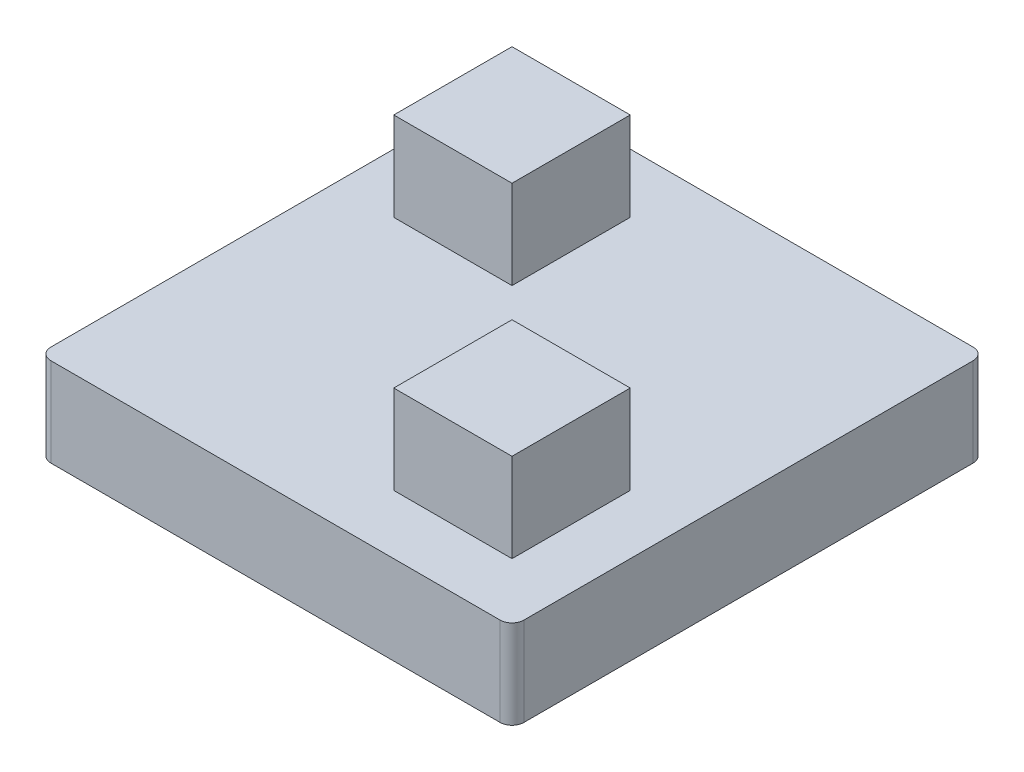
ISO-10303-21;
HEADER;
FILE_DESCRIPTION(('STEP AP214'),'2;1');
FILE_NAME('part.step','',(''),(''),'','','');
FILE_SCHEMA(('AUTOMOTIVE_DESIGN { 1 0 10303 214 1 1 1 1 }'));
ENDSEC;
DATA;
#1=APPLICATION_CONTEXT('core data for automotive mechanical design processes');
#2=APPLICATION_PROTOCOL_DEFINITION('international standard','automotive_design',2000,#1);
#3=PRODUCT_CONTEXT('',#1,'mechanical');
#4=PRODUCT('Part','Part','',(#3));
#5=PRODUCT_RELATED_PRODUCT_CATEGORY('part','',(#4));
#6=PRODUCT_DEFINITION_FORMATION('','',#4);
#7=PRODUCT_DEFINITION_CONTEXT('part definition',#1,'design');
#8=PRODUCT_DEFINITION('design','',#6,#7);
#9=PRODUCT_DEFINITION_SHAPE('','',#8);
#10=(LENGTH_UNIT() NAMED_UNIT(*) SI_UNIT(.MILLI.,.METRE.));
#11=(NAMED_UNIT(*) PLANE_ANGLE_UNIT() SI_UNIT($,.RADIAN.));
#12=(NAMED_UNIT(*) SI_UNIT($,.STERADIAN.) SOLID_ANGLE_UNIT());
#13=UNCERTAINTY_MEASURE_WITH_UNIT(LENGTH_MEASURE(1.E-05),#10,'distance_accuracy_value','');
#14=(GEOMETRIC_REPRESENTATION_CONTEXT(3) GLOBAL_UNCERTAINTY_ASSIGNED_CONTEXT((#13)) GLOBAL_UNIT_ASSIGNED_CONTEXT((#10,
#11,#12)) REPRESENTATION_CONTEXT('',''));
#15=CARTESIAN_POINT('',(0.,0.,0.));
#16=DIRECTION('',(0.,0.,1.));
#17=DIRECTION('',(1.,0.,0.));
#18=AXIS2_PLACEMENT_3D('',#15,#16,#17);
#19=CARTESIAN_POINT('',(-50.8,19.05,50.8));
#20=DIRECTION('',(0.,1.,0.));
#21=DIRECTION('',(0.,0.,1.));
#22=AXIS2_PLACEMENT_3D('',#19,#20,#21);
#23=PLANE('',#22);
#24=DIRECTION('',(-1.,0.,0.));
#25=VECTOR('',#24,1.);
#26=CARTESIAN_POINT('',(38.1,19.05,12.7));
#27=LINE('',#26,#25);
#28=CARTESIAN_POINT('',(38.1,19.05,12.7));
#29=VERTEX_POINT('',#28);
#30=CARTESIAN_POINT('',(12.7,19.05,12.7));
#31=VERTEX_POINT('',#30);
#32=EDGE_CURVE('E182',#29,#31,#27,.T.);
#33=ORIENTED_EDGE('',*,*,#32,.F.);
#34=DIRECTION('',(0.,0.,-1.));
#35=VECTOR('',#34,1.);
#36=CARTESIAN_POINT('',(38.1,19.05,38.1));
#37=LINE('',#36,#35);
#38=CARTESIAN_POINT('',(38.1,19.05,38.1));
#39=VERTEX_POINT('',#38);
#40=EDGE_CURVE('E176',#39,#29,#37,.T.);
#41=ORIENTED_EDGE('',*,*,#40,.F.);
#42=DIRECTION('',(1.,0.,0.));
#43=VECTOR('',#42,1.);
#44=CARTESIAN_POINT('',(38.1,19.05,38.1));
#45=LINE('',#44,#43);
#46=CARTESIAN_POINT('',(12.7,19.05,38.1));
#47=VERTEX_POINT('',#46);
#48=EDGE_CURVE('E201',#47,#39,#45,.T.);
#49=ORIENTED_EDGE('',*,*,#48,.F.);
#50=DIRECTION('',(0.,0.,1.));
#51=VECTOR('',#50,1.);
#52=CARTESIAN_POINT('',(12.7,19.05,38.1));
#53=LINE('',#52,#51);
#54=EDGE_CURVE('E198',#31,#47,#53,.T.);
#55=ORIENTED_EDGE('',*,*,#54,.F.);
#56=EDGE_LOOP('',(#33,#41,#49,#55));
#57=FACE_BOUND('',#56,.T.);
#58=DIRECTION('',(0.,0.,1.));
#59=VECTOR('',#58,1.);
#60=CARTESIAN_POINT('',(-50.8,19.05,-50.8));
#61=LINE('',#60,#59);
#62=CARTESIAN_POINT('',(-50.8,19.05,-48.26));
#63=VERTEX_POINT('',#62);
#64=CARTESIAN_POINT('',(-50.8,19.05,48.26));
#65=VERTEX_POINT('',#64);
#66=EDGE_CURVE('E234',#63,#65,#61,.T.);
#67=ORIENTED_EDGE('',*,*,#66,.T.);
#68=CARTESIAN_POINT('',(-48.26,19.05,48.26));
#69=DIRECTION('',(0.,1.,0.));
#70=DIRECTION('',(0.,0.,1.));
#71=AXIS2_PLACEMENT_3D('',#68,#69,#70);
#72=CIRCLE('',#71,2.54);
#73=CARTESIAN_POINT('',(-48.26,19.05,50.8));
#74=VERTEX_POINT('',#73);
#75=EDGE_CURVE('E267',#65,#74,#72,.T.);
#76=ORIENTED_EDGE('',*,*,#75,.T.);
#77=DIRECTION('',(1.,0.,0.));
#78=VECTOR('',#77,1.);
#79=CARTESIAN_POINT('',(-50.8,19.05,50.8));
#80=LINE('',#79,#78);
#81=CARTESIAN_POINT('',(48.26,19.05,50.8));
#82=VERTEX_POINT('',#81);
#83=EDGE_CURVE('E237',#74,#82,#80,.T.);
#84=ORIENTED_EDGE('',*,*,#83,.T.);
#85=CARTESIAN_POINT('',(48.26,19.05,48.26));
#86=DIRECTION('',(0.,1.,0.));
#87=DIRECTION('',(0.,0.,1.));
#88=AXIS2_PLACEMENT_3D('',#85,#86,#87);
#89=CIRCLE('',#88,2.54);
#90=CARTESIAN_POINT('',(50.8,19.05,48.26));
#91=VERTEX_POINT('',#90);
#92=EDGE_CURVE('E265',#82,#91,#89,.T.);
#93=ORIENTED_EDGE('',*,*,#92,.T.);
#94=DIRECTION('',(0.,0.,-1.));
#95=VECTOR('',#94,1.);
#96=CARTESIAN_POINT('',(50.8,19.05,-50.8));
#97=LINE('',#96,#95);
#98=CARTESIAN_POINT('',(50.8,19.05,-48.26));
#99=VERTEX_POINT('',#98);
#100=EDGE_CURVE('E240',#91,#99,#97,.T.);
#101=ORIENTED_EDGE('',*,*,#100,.T.);
#102=CARTESIAN_POINT('',(48.26,19.05,-48.26));
#103=DIRECTION('',(0.,1.,0.));
#104=DIRECTION('',(0.,0.,1.));
#105=AXIS2_PLACEMENT_3D('',#102,#103,#104);
#106=CIRCLE('',#105,2.54);
#107=CARTESIAN_POINT('',(48.26,19.05,-50.8));
#108=VERTEX_POINT('',#107);
#109=EDGE_CURVE('E57',#99,#108,#106,.T.);
#110=ORIENTED_EDGE('',*,*,#109,.T.);
#111=DIRECTION('',(-1.,0.,0.));
#112=VECTOR('',#111,1.);
#113=CARTESIAN_POINT('',(-50.8,19.05,-50.8));
#114=LINE('',#113,#112);
#115=CARTESIAN_POINT('',(-48.26,19.05,-50.8));
#116=VERTEX_POINT('',#115);
#117=EDGE_CURVE('E242',#108,#116,#114,.T.);
#118=ORIENTED_EDGE('',*,*,#117,.T.);
#119=CARTESIAN_POINT('',(-48.26,19.05,-48.26));
#120=DIRECTION('',(0.,1.,0.));
#121=DIRECTION('',(0.,0.,1.));
#122=AXIS2_PLACEMENT_3D('',#119,#120,#121);
#123=CIRCLE('',#122,2.54);
#124=EDGE_CURVE('E262',#116,#63,#123,.T.);
#125=ORIENTED_EDGE('',*,*,#124,.T.);
#126=EDGE_LOOP('',(#67,#76,#84,#93,#101,#110,#118,#125));
#127=FACE_BOUND('',#126,.T.);
#128=DIRECTION('',(-1.,0.,0.));
#129=VECTOR('',#128,1.);
#130=CARTESIAN_POINT('',(-12.7,19.05,-38.1));
#131=LINE('',#130,#129);
#132=CARTESIAN_POINT('',(-12.7,19.05,-38.1));
#133=VERTEX_POINT('',#132);
#134=CARTESIAN_POINT('',(-38.1,19.05,-38.1));
#135=VERTEX_POINT('',#134);
#136=EDGE_CURVE('E193',#133,#135,#131,.T.);
#137=ORIENTED_EDGE('',*,*,#136,.F.);
#138=DIRECTION('',(0.,0.,-1.));
#139=VECTOR('',#138,1.);
#140=CARTESIAN_POINT('',(-12.7,19.05,-38.1));
#141=LINE('',#140,#139);
#142=CARTESIAN_POINT('',(-12.7,19.05,-12.7));
#143=VERTEX_POINT('',#142);
#144=EDGE_CURVE('E186',#143,#133,#141,.T.);
#145=ORIENTED_EDGE('',*,*,#144,.F.);
#146=DIRECTION('',(1.,0.,0.));
#147=VECTOR('',#146,1.);
#148=CARTESIAN_POINT('',(-12.7,19.05,-12.7));
#149=LINE('',#148,#147);
#150=CARTESIAN_POINT('',(-38.1,19.05,-12.7));
#151=VERTEX_POINT('',#150);
#152=EDGE_CURVE('E160',#151,#143,#149,.T.);
#153=ORIENTED_EDGE('',*,*,#152,.F.);
#154=DIRECTION('',(0.,0.,1.));
#155=VECTOR('',#154,1.);
#156=CARTESIAN_POINT('',(-38.1,19.05,-38.1));
#157=LINE('',#156,#155);
#158=EDGE_CURVE('E156',#135,#151,#157,.T.);
#159=ORIENTED_EDGE('',*,*,#158,.F.);
#160=EDGE_LOOP('',(#137,#145,#153,#159));
#161=FACE_BOUND('',#160,.T.);
#162=ADVANCED_FACE('F36',(#57,#127,#161),#23,.T.);
#163=CARTESIAN_POINT('',(-50.8,19.05,-50.8));
#164=DIRECTION('',(1.,0.,0.));
#165=DIRECTION('',(0.,0.,-1.));
#166=AXIS2_PLACEMENT_3D('',#163,#164,#165);
#167=PLANE('',#166);
#168=DIRECTION('',(0.,0.,1.));
#169=VECTOR('',#168,1.);
#170=CARTESIAN_POINT('',(-50.8,0.,-50.8));
#171=LINE('',#170,#169);
#172=CARTESIAN_POINT('',(-50.8,0.,-48.26));
#173=VERTEX_POINT('',#172);
#174=CARTESIAN_POINT('',(-50.8,0.,48.26));
#175=VERTEX_POINT('',#174);
#176=EDGE_CURVE('E222',#173,#175,#171,.T.);
#177=ORIENTED_EDGE('',*,*,#176,.T.);
#178=DIRECTION('',(0.,-1.,0.));
#179=VECTOR('',#178,1.);
#180=CARTESIAN_POINT('',(-50.8,19.05,48.26));
#181=LINE('',#180,#179);
#182=EDGE_CURVE('E260',#175,#65,#181,.F.);
#183=ORIENTED_EDGE('',*,*,#182,.T.);
#184=ORIENTED_EDGE('',*,*,#66,.F.);
#185=DIRECTION('',(0.,-1.,0.));
#186=VECTOR('',#185,1.);
#187=CARTESIAN_POINT('',(-50.8,19.05,-48.26));
#188=LINE('',#187,#186);
#189=EDGE_CURVE('E257',#63,#173,#188,.T.);
#190=ORIENTED_EDGE('',*,*,#189,.T.);
#191=EDGE_LOOP('',(#177,#183,#184,#190));
#192=FACE_BOUND('',#191,.T.);
#193=ADVANCED_FACE('F38',(#192),#167,.F.);
#194=CARTESIAN_POINT('',(-50.8,19.05,50.8));
#195=DIRECTION('',(0.,0.,-1.));
#196=DIRECTION('',(-1.,0.,0.));
#197=AXIS2_PLACEMENT_3D('',#194,#195,#196);
#198=PLANE('',#197);
#199=ORIENTED_EDGE('',*,*,#83,.F.);
#200=DIRECTION('',(0.,-1.,0.));
#201=VECTOR('',#200,1.);
#202=CARTESIAN_POINT('',(-48.26,19.05,50.8));
#203=LINE('',#202,#201);
#204=CARTESIAN_POINT('',(-48.26,0.,50.8));
#205=VERTEX_POINT('',#204);
#206=EDGE_CURVE('E246',#74,#205,#203,.T.);
#207=ORIENTED_EDGE('',*,*,#206,.T.);
#208=DIRECTION('',(1.,0.,0.));
#209=VECTOR('',#208,1.);
#210=CARTESIAN_POINT('',(-50.8,0.,50.8));
#211=LINE('',#210,#209);
#212=CARTESIAN_POINT('',(48.26,0.,50.8));
#213=VERTEX_POINT('',#212);
#214=EDGE_CURVE('E226',#205,#213,#211,.T.);
#215=ORIENTED_EDGE('',*,*,#214,.T.);
#216=DIRECTION('',(0.,-1.,0.));
#217=VECTOR('',#216,1.);
#218=CARTESIAN_POINT('',(48.26,19.05,50.8));
#219=LINE('',#218,#217);
#220=EDGE_CURVE('E244',#213,#82,#219,.F.);
#221=ORIENTED_EDGE('',*,*,#220,.T.);
#222=EDGE_LOOP('',(#199,#207,#215,#221));
#223=FACE_BOUND('',#222,.T.);
#224=ADVANCED_FACE('F304',(#223),#198,.F.);
#225=CARTESIAN_POINT('',(50.8,19.05,-50.8));
#226=DIRECTION('',(-1.,0.,0.));
#227=DIRECTION('',(0.,0.,1.));
#228=AXIS2_PLACEMENT_3D('',#225,#226,#227);
#229=PLANE('',#228);
#230=ORIENTED_EDGE('',*,*,#100,.F.);
#231=DIRECTION('',(0.,-1.,0.));
#232=VECTOR('',#231,1.);
#233=CARTESIAN_POINT('',(50.8,19.05,48.26));
#234=LINE('',#233,#232);
#235=CARTESIAN_POINT('',(50.8,0.,48.26));
#236=VERTEX_POINT('',#235);
#237=EDGE_CURVE('E271',#91,#236,#234,.T.);
#238=ORIENTED_EDGE('',*,*,#237,.T.);
#239=DIRECTION('',(0.,0.,-1.));
#240=VECTOR('',#239,1.);
#241=CARTESIAN_POINT('',(50.8,0.,-50.8));
#242=LINE('',#241,#240);
#243=CARTESIAN_POINT('',(50.8,0.,-48.26));
#244=VERTEX_POINT('',#243);
#245=EDGE_CURVE('E229',#236,#244,#242,.T.);
#246=ORIENTED_EDGE('',*,*,#245,.T.);
#247=DIRECTION('',(0.,-1.,0.));
#248=VECTOR('',#247,1.);
#249=CARTESIAN_POINT('',(50.8,19.05,-48.26));
#250=LINE('',#249,#248);
#251=EDGE_CURVE('E269',#244,#99,#250,.F.);
#252=ORIENTED_EDGE('',*,*,#251,.T.);
#253=EDGE_LOOP('',(#230,#238,#246,#252));
#254=FACE_BOUND('',#253,.T.);
#255=ADVANCED_FACE('F277',(#254),#229,.F.);
#256=CARTESIAN_POINT('',(-50.8,19.05,-50.8));
#257=DIRECTION('',(0.,0.,1.));
#258=DIRECTION('',(1.,0.,0.));
#259=AXIS2_PLACEMENT_3D('',#256,#257,#258);
#260=PLANE('',#259);
#261=ORIENTED_EDGE('',*,*,#117,.F.);
#262=DIRECTION('',(0.,-1.,0.));
#263=VECTOR('',#262,1.);
#264=CARTESIAN_POINT('',(48.26,19.05,-50.8));
#265=LINE('',#264,#263);
#266=CARTESIAN_POINT('',(48.26,0.,-50.8));
#267=VERTEX_POINT('',#266);
#268=EDGE_CURVE('E11',#108,#267,#265,.T.);
#269=ORIENTED_EDGE('',*,*,#268,.T.);
#270=DIRECTION('',(-1.,0.,0.));
#271=VECTOR('',#270,1.);
#272=CARTESIAN_POINT('',(-50.8,0.,-50.8));
#273=LINE('',#272,#271);
#274=CARTESIAN_POINT('',(-48.26,0.,-50.8));
#275=VERTEX_POINT('',#274);
#276=EDGE_CURVE('E232',#267,#275,#273,.T.);
#277=ORIENTED_EDGE('',*,*,#276,.T.);
#278=DIRECTION('',(0.,-1.,0.));
#279=VECTOR('',#278,1.);
#280=CARTESIAN_POINT('',(-48.26,19.05,-50.8));
#281=LINE('',#280,#279);
#282=EDGE_CURVE('E44',#275,#116,#281,.F.);
#283=ORIENTED_EDGE('',*,*,#282,.T.);
#284=EDGE_LOOP('',(#261,#269,#277,#283));
#285=FACE_BOUND('',#284,.T.);
#286=ADVANCED_FACE('F288',(#285),#260,.F.);
#287=CARTESIAN_POINT('',(-50.8,0.,50.8));
#288=DIRECTION('',(0.,1.,0.));
#289=DIRECTION('',(0.,0.,1.));
#290=AXIS2_PLACEMENT_3D('',#287,#288,#289);
#291=PLANE('',#290);
#292=ORIENTED_EDGE('',*,*,#214,.F.);
#293=CARTESIAN_POINT('',(-48.26,0.,48.26));
#294=DIRECTION('',(0.,1.,0.));
#295=DIRECTION('',(0.,0.,1.));
#296=AXIS2_PLACEMENT_3D('',#293,#294,#295);
#297=CIRCLE('',#296,2.54);
#298=EDGE_CURVE('E255',#205,#175,#297,.F.);
#299=ORIENTED_EDGE('',*,*,#298,.T.);
#300=ORIENTED_EDGE('',*,*,#176,.F.);
#301=CARTESIAN_POINT('',(-48.26,0.,-48.26));
#302=DIRECTION('',(0.,1.,0.));
#303=DIRECTION('',(0.,0.,1.));
#304=AXIS2_PLACEMENT_3D('',#301,#302,#303);
#305=CIRCLE('',#304,2.54);
#306=EDGE_CURVE('E249',#173,#275,#305,.F.);
#307=ORIENTED_EDGE('',*,*,#306,.T.);
#308=ORIENTED_EDGE('',*,*,#276,.F.);
#309=CARTESIAN_POINT('',(48.26,0.,-48.26));
#310=DIRECTION('',(0.,1.,0.));
#311=DIRECTION('',(0.,0.,1.));
#312=AXIS2_PLACEMENT_3D('',#309,#310,#311);
#313=CIRCLE('',#312,2.54);
#314=EDGE_CURVE('E251',#267,#244,#313,.F.);
#315=ORIENTED_EDGE('',*,*,#314,.T.);
#316=ORIENTED_EDGE('',*,*,#245,.F.);
#317=CARTESIAN_POINT('',(48.26,0.,48.26));
#318=DIRECTION('',(0.,1.,0.));
#319=DIRECTION('',(0.,0.,1.));
#320=AXIS2_PLACEMENT_3D('',#317,#318,#319);
#321=CIRCLE('',#320,2.54);
#322=EDGE_CURVE('E253',#236,#213,#321,.F.);
#323=ORIENTED_EDGE('',*,*,#322,.T.);
#324=EDGE_LOOP('',(#292,#299,#300,#307,#308,#315,#316,#323));
#325=FACE_BOUND('',#324,.T.);
#326=ADVANCED_FACE('F283',(#325),#291,.F.);
#327=CARTESIAN_POINT('',(38.1,38.1,38.1));
#328=DIRECTION('',(-1.,0.,0.));
#329=DIRECTION('',(0.,0.,1.));
#330=AXIS2_PLACEMENT_3D('',#327,#328,#329);
#331=PLANE('',#330);
#332=ORIENTED_EDGE('',*,*,#40,.T.);
#333=DIRECTION('',(0.,-1.,0.));
#334=VECTOR('',#333,1.);
#335=CARTESIAN_POINT('',(38.1,38.1,12.7));
#336=LINE('',#335,#334);
#337=CARTESIAN_POINT('',(38.1,38.1,12.7));
#338=VERTEX_POINT('',#337);
#339=EDGE_CURVE('E220',#338,#29,#336,.T.);
#340=ORIENTED_EDGE('',*,*,#339,.F.);
#341=DIRECTION('',(0.,0.,-1.));
#342=VECTOR('',#341,1.);
#343=CARTESIAN_POINT('',(38.1,38.1,38.1));
#344=LINE('',#343,#342);
#345=CARTESIAN_POINT('',(38.1,38.1,38.1));
#346=VERTEX_POINT('',#345);
#347=EDGE_CURVE('E203',#346,#338,#344,.T.);
#348=ORIENTED_EDGE('',*,*,#347,.F.);
#349=DIRECTION('',(0.,-1.,0.));
#350=VECTOR('',#349,1.);
#351=CARTESIAN_POINT('',(38.1,38.1,38.1));
#352=LINE('',#351,#350);
#353=EDGE_CURVE('E212',#346,#39,#352,.T.);
#354=ORIENTED_EDGE('',*,*,#353,.T.);
#355=EDGE_LOOP('',(#332,#340,#348,#354));
#356=FACE_BOUND('',#355,.T.);
#357=ADVANCED_FACE('F347',(#356),#331,.F.);
#358=CARTESIAN_POINT('',(38.1,38.1,12.7));
#359=DIRECTION('',(0.,0.,1.));
#360=DIRECTION('',(1.,0.,0.));
#361=AXIS2_PLACEMENT_3D('',#358,#359,#360);
#362=PLANE('',#361);
#363=ORIENTED_EDGE('',*,*,#32,.T.);
#364=DIRECTION('',(0.,-1.,0.));
#365=VECTOR('',#364,1.);
#366=CARTESIAN_POINT('',(12.7,38.1,12.7));
#367=LINE('',#366,#365);
#368=CARTESIAN_POINT('',(12.7,38.1,12.7));
#369=VERTEX_POINT('',#368);
#370=EDGE_CURVE('E217',#369,#31,#367,.T.);
#371=ORIENTED_EDGE('',*,*,#370,.F.);
#372=DIRECTION('',(-1.,0.,0.));
#373=VECTOR('',#372,1.);
#374=CARTESIAN_POINT('',(38.1,38.1,12.7));
#375=LINE('',#374,#373);
#376=EDGE_CURVE('E206',#338,#369,#375,.T.);
#377=ORIENTED_EDGE('',*,*,#376,.F.);
#378=ORIENTED_EDGE('',*,*,#339,.T.);
#379=EDGE_LOOP('',(#363,#371,#377,#378));
#380=FACE_BOUND('',#379,.T.);
#381=ADVANCED_FACE('F354',(#380),#362,.F.);
#382=CARTESIAN_POINT('',(12.7,38.1,38.1));
#383=DIRECTION('',(1.,0.,0.));
#384=DIRECTION('',(0.,0.,-1.));
#385=AXIS2_PLACEMENT_3D('',#382,#383,#384);
#386=PLANE('',#385);
#387=ORIENTED_EDGE('',*,*,#54,.T.);
#388=DIRECTION('',(0.,-1.,0.));
#389=VECTOR('',#388,1.);
#390=CARTESIAN_POINT('',(12.7,38.1,38.1));
#391=LINE('',#390,#389);
#392=CARTESIAN_POINT('',(12.7,38.1,38.1));
#393=VERTEX_POINT('',#392);
#394=EDGE_CURVE('E215',#393,#47,#391,.T.);
#395=ORIENTED_EDGE('',*,*,#394,.F.);
#396=DIRECTION('',(0.,0.,1.));
#397=VECTOR('',#396,1.);
#398=CARTESIAN_POINT('',(12.7,38.1,38.1));
#399=LINE('',#398,#397);
#400=EDGE_CURVE('E208',#369,#393,#399,.T.);
#401=ORIENTED_EDGE('',*,*,#400,.F.);
#402=ORIENTED_EDGE('',*,*,#370,.T.);
#403=EDGE_LOOP('',(#387,#395,#401,#402));
#404=FACE_BOUND('',#403,.T.);
#405=ADVANCED_FACE('F361',(#404),#386,.F.);
#406=CARTESIAN_POINT('',(38.1,38.1,38.1));
#407=DIRECTION('',(0.,0.,-1.));
#408=DIRECTION('',(-1.,0.,0.));
#409=AXIS2_PLACEMENT_3D('',#406,#407,#408);
#410=PLANE('',#409);
#411=ORIENTED_EDGE('',*,*,#48,.T.);
#412=ORIENTED_EDGE('',*,*,#353,.F.);
#413=DIRECTION('',(1.,0.,0.));
#414=VECTOR('',#413,1.);
#415=CARTESIAN_POINT('',(38.1,38.1,38.1));
#416=LINE('',#415,#414);
#417=EDGE_CURVE('E210',#393,#346,#416,.T.);
#418=ORIENTED_EDGE('',*,*,#417,.F.);
#419=ORIENTED_EDGE('',*,*,#394,.T.);
#420=EDGE_LOOP('',(#411,#412,#418,#419));
#421=FACE_BOUND('',#420,.T.);
#422=ADVANCED_FACE('F369',(#421),#410,.F.);
#423=CARTESIAN_POINT('',(38.1,38.1,38.1));
#424=DIRECTION('',(0.,1.,0.));
#425=DIRECTION('',(0.,0.,1.));
#426=AXIS2_PLACEMENT_3D('',#423,#424,#425);
#427=PLANE('',#426);
#428=ORIENTED_EDGE('',*,*,#347,.T.);
#429=ORIENTED_EDGE('',*,*,#376,.T.);
#430=ORIENTED_EDGE('',*,*,#400,.T.);
#431=ORIENTED_EDGE('',*,*,#417,.T.);
#432=EDGE_LOOP('',(#428,#429,#430,#431));
#433=FACE_BOUND('',#432,.T.);
#434=ADVANCED_FACE('F377',(#433),#427,.T.);
#435=CARTESIAN_POINT('',(-12.7,74.0210244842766,-38.1));
#436=DIRECTION('',(-1.,0.,0.));
#437=DIRECTION('',(0.,0.,1.));
#438=AXIS2_PLACEMENT_3D('',#435,#436,#437);
#439=PLANE('',#438);
#440=DIRECTION('',(0.,0.,-1.));
#441=VECTOR('',#440,1.);
#442=CARTESIAN_POINT('',(-12.7,38.1,-38.1));
#443=LINE('',#442,#441);
#444=CARTESIAN_POINT('',(-12.7,38.1,-12.7));
#445=VERTEX_POINT('',#444);
#446=CARTESIAN_POINT('',(-12.7,38.1,-38.1));
#447=VERTEX_POINT('',#446);
#448=EDGE_CURVE('E170',#445,#447,#443,.T.);
#449=ORIENTED_EDGE('',*,*,#448,.F.);
#450=DIRECTION('',(0.,-1.,0.));
#451=VECTOR('',#450,1.);
#452=CARTESIAN_POINT('',(-12.7,74.0210244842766,-12.7));
#453=LINE('',#452,#451);
#454=EDGE_CURVE('E165',#445,#143,#453,.T.);
#455=ORIENTED_EDGE('',*,*,#454,.T.);
#456=ORIENTED_EDGE('',*,*,#144,.T.);
#457=DIRECTION('',(0.,-1.,0.));
#458=VECTOR('',#457,1.);
#459=CARTESIAN_POINT('',(-12.7,74.0210244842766,-38.1));
#460=LINE('',#459,#458);
#461=EDGE_CURVE('E191',#447,#133,#460,.T.);
#462=ORIENTED_EDGE('',*,*,#461,.F.);
#463=EDGE_LOOP('',(#449,#455,#456,#462));
#464=FACE_BOUND('',#463,.T.);
#465=ADVANCED_FACE('F385',(#464),#439,.F.);
#466=CARTESIAN_POINT('',(-12.7,74.0210244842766,-38.1));
#467=DIRECTION('',(0.,0.,1.));
#468=DIRECTION('',(1.,0.,0.));
#469=AXIS2_PLACEMENT_3D('',#466,#467,#468);
#470=PLANE('',#469);
#471=DIRECTION('',(-1.,0.,0.));
#472=VECTOR('',#471,1.);
#473=CARTESIAN_POINT('',(-12.7,38.1,-38.1));
#474=LINE('',#473,#472);
#475=CARTESIAN_POINT('',(-38.1,38.1,-38.1));
#476=VERTEX_POINT('',#475);
#477=EDGE_CURVE('E174',#447,#476,#474,.T.);
#478=ORIENTED_EDGE('',*,*,#477,.F.);
#479=ORIENTED_EDGE('',*,*,#461,.T.);
#480=ORIENTED_EDGE('',*,*,#136,.T.);
#481=DIRECTION('',(0.,-1.,0.));
#482=VECTOR('',#481,1.);
#483=CARTESIAN_POINT('',(-38.1,74.0210244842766,-38.1));
#484=LINE('',#483,#482);
#485=EDGE_CURVE('E194',#476,#135,#484,.T.);
#486=ORIENTED_EDGE('',*,*,#485,.F.);
#487=EDGE_LOOP('',(#478,#479,#480,#486));
#488=FACE_BOUND('',#487,.T.);
#489=ADVANCED_FACE('F393',(#488),#470,.F.);
#490=CARTESIAN_POINT('',(-38.1,74.0210244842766,-38.1));
#491=DIRECTION('',(1.,0.,0.));
#492=DIRECTION('',(0.,0.,-1.));
#493=AXIS2_PLACEMENT_3D('',#490,#491,#492);
#494=PLANE('',#493);
#495=DIRECTION('',(0.,0.,1.));
#496=VECTOR('',#495,1.);
#497=CARTESIAN_POINT('',(-38.1,38.1,-38.1));
#498=LINE('',#497,#496);
#499=CARTESIAN_POINT('',(-38.1,38.1,-12.7));
#500=VERTEX_POINT('',#499);
#501=EDGE_CURVE('E153',#476,#500,#498,.T.);
#502=ORIENTED_EDGE('',*,*,#501,.F.);
#503=ORIENTED_EDGE('',*,*,#485,.T.);
#504=ORIENTED_EDGE('',*,*,#158,.T.);
#505=DIRECTION('',(0.,-1.,0.));
#506=VECTOR('',#505,1.);
#507=CARTESIAN_POINT('',(-38.1,74.0210244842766,-12.7));
#508=LINE('',#507,#506);
#509=EDGE_CURVE('E149',#500,#151,#508,.T.);
#510=ORIENTED_EDGE('',*,*,#509,.F.);
#511=EDGE_LOOP('',(#502,#503,#504,#510));
#512=FACE_BOUND('',#511,.T.);
#513=ADVANCED_FACE('F151',(#512),#494,.F.);
#514=CARTESIAN_POINT('',(-12.7,74.0210244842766,-12.7));
#515=DIRECTION('',(0.,0.,-1.));
#516=DIRECTION('',(-1.,0.,0.));
#517=AXIS2_PLACEMENT_3D('',#514,#515,#516);
#518=PLANE('',#517);
#519=DIRECTION('',(1.,0.,0.));
#520=VECTOR('',#519,1.);
#521=CARTESIAN_POINT('',(-12.7,38.1,-12.7));
#522=LINE('',#521,#520);
#523=EDGE_CURVE('E163',#500,#445,#522,.T.);
#524=ORIENTED_EDGE('',*,*,#523,.F.);
#525=ORIENTED_EDGE('',*,*,#509,.T.);
#526=ORIENTED_EDGE('',*,*,#152,.T.);
#527=ORIENTED_EDGE('',*,*,#454,.F.);
#528=EDGE_LOOP('',(#524,#525,#526,#527));
#529=FACE_BOUND('',#528,.T.);
#530=ADVANCED_FACE('F164',(#529),#518,.F.);
#531=CARTESIAN_POINT('',(38.1,38.1,38.1));
#532=DIRECTION('',(0.,1.,0.));
#533=DIRECTION('',(0.,0.,1.));
#534=AXIS2_PLACEMENT_3D('',#531,#532,#533);
#535=PLANE('',#534);
#536=ORIENTED_EDGE('',*,*,#523,.T.);
#537=ORIENTED_EDGE('',*,*,#448,.T.);
#538=ORIENTED_EDGE('',*,*,#477,.T.);
#539=ORIENTED_EDGE('',*,*,#501,.T.);
#540=EDGE_LOOP('',(#536,#537,#538,#539));
#541=FACE_BOUND('',#540,.T.);
#542=ADVANCED_FACE('F173',(#541),#535,.T.);
#543=CARTESIAN_POINT('',(-48.26,19.05,48.26));
#544=DIRECTION('',(0.,-1.,0.));
#545=DIRECTION('',(0.,0.,-1.));
#546=AXIS2_PLACEMENT_3D('',#543,#544,#545);
#547=CYLINDRICAL_SURFACE('',#546,2.54);
#548=ORIENTED_EDGE('',*,*,#75,.F.);
#549=ORIENTED_EDGE('',*,*,#182,.F.);
#550=ORIENTED_EDGE('',*,*,#298,.F.);
#551=ORIENTED_EDGE('',*,*,#206,.F.);
#552=EDGE_LOOP('',(#548,#549,#550,#551));
#553=FACE_BOUND('',#552,.T.);
#554=ADVANCED_FACE('F301',(#553),#547,.T.);
#555=CARTESIAN_POINT('',(48.26,19.05,48.26));
#556=DIRECTION('',(0.,-1.,0.));
#557=DIRECTION('',(0.,0.,-1.));
#558=AXIS2_PLACEMENT_3D('',#555,#556,#557);
#559=CYLINDRICAL_SURFACE('',#558,2.54);
#560=ORIENTED_EDGE('',*,*,#92,.F.);
#561=ORIENTED_EDGE('',*,*,#220,.F.);
#562=ORIENTED_EDGE('',*,*,#322,.F.);
#563=ORIENTED_EDGE('',*,*,#237,.F.);
#564=EDGE_LOOP('',(#560,#561,#562,#563));
#565=FACE_BOUND('',#564,.T.);
#566=ADVANCED_FACE('F306',(#565),#559,.T.);
#567=CARTESIAN_POINT('',(48.26,19.05,-48.26));
#568=DIRECTION('',(0.,-1.,0.));
#569=DIRECTION('',(0.,0.,-1.));
#570=AXIS2_PLACEMENT_3D('',#567,#568,#569);
#571=CYLINDRICAL_SURFACE('',#570,2.54);
#572=ORIENTED_EDGE('',*,*,#109,.F.);
#573=ORIENTED_EDGE('',*,*,#251,.F.);
#574=ORIENTED_EDGE('',*,*,#314,.F.);
#575=ORIENTED_EDGE('',*,*,#268,.F.);
#576=EDGE_LOOP('',(#572,#573,#574,#575));
#577=FACE_BOUND('',#576,.T.);
#578=ADVANCED_FACE('F287',(#577),#571,.T.);
#579=CARTESIAN_POINT('',(-48.26,19.05,-48.26));
#580=DIRECTION('',(0.,-1.,0.));
#581=DIRECTION('',(0.,0.,-1.));
#582=AXIS2_PLACEMENT_3D('',#579,#580,#581);
#583=CYLINDRICAL_SURFACE('',#582,2.54);
#584=ORIENTED_EDGE('',*,*,#124,.F.);
#585=ORIENTED_EDGE('',*,*,#282,.F.);
#586=ORIENTED_EDGE('',*,*,#306,.F.);
#587=ORIENTED_EDGE('',*,*,#189,.F.);
#588=EDGE_LOOP('',(#584,#585,#586,#587));
#589=FACE_BOUND('',#588,.T.);
#590=ADVANCED_FACE('F294',(#589),#583,.T.);
#591=CLOSED_SHELL('',(#162,#193,#224,#255,#286,#326,#357,#381,#405,#422,#434,#465,#489,#513,
#530,#542,#554,#566,#578,#590));
#592=MANIFOLD_SOLID_BREP('B2',#591);
#593=ADVANCED_BREP_SHAPE_REPRESENTATION('',(#18,#592),#14);
#594=SHAPE_DEFINITION_REPRESENTATION(#9,#593);
ENDSEC;
END-ISO-10303-21;
